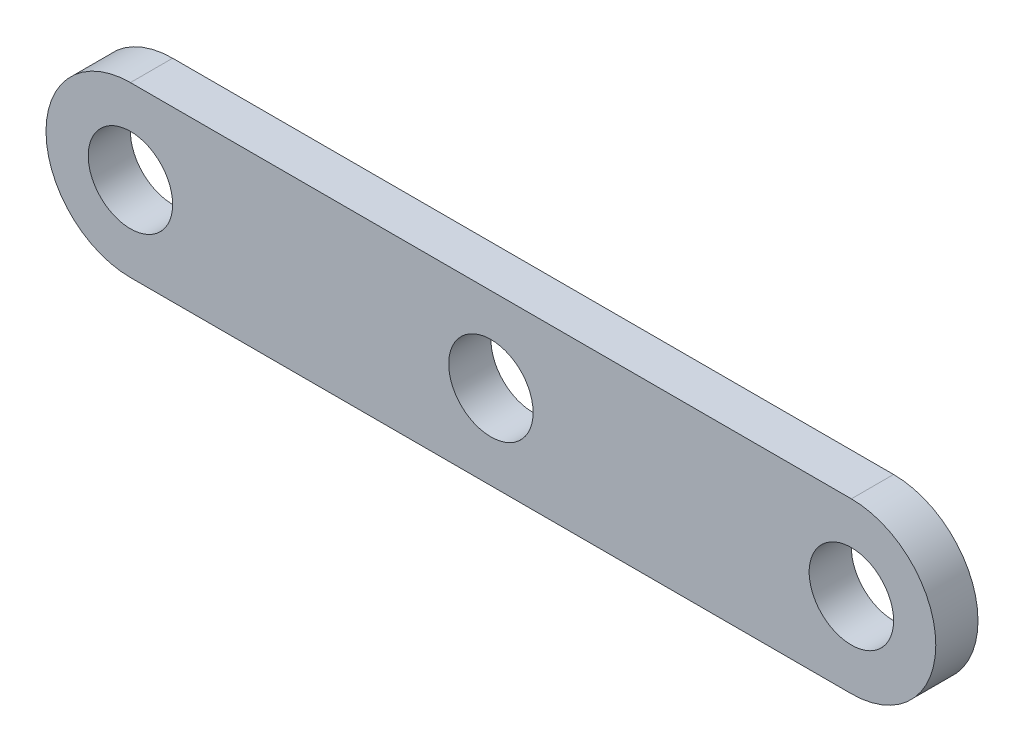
from build123d import *

# Parameters (mm, degrees)
SKETCH1_R           = 6.35
BOSS_EXTRUDE1_DEPTH = 6.35


with BuildPart() as part:
    # Sketch1 → Boss-Extrude1 (new body)
    with BuildSketch(Plane.XY):
        with BuildLine():
            Line((0, 12.7), (108.458, 12.7))
            ThreePointArc((108.458, 12.7), (121.158, 0), (108.458, -12.7))
            Line((108.458, -12.7), (0, -12.7))
            ThreePointArc((0, -12.7), (-12.7, 0), (0, 12.7))
        make_face()
        Circle(SKETCH1_R, mode=Mode.SUBTRACT)
        with Locations((108.458, 0)):
            Circle(SKETCH1_R, mode=Mode.SUBTRACT)
        with Locations((54.229, 0)):
            Circle(SKETCH1_R, mode=Mode.SUBTRACT)
    extrude(amount=BOSS_EXTRUDE1_DEPTH)


solid = part.part
